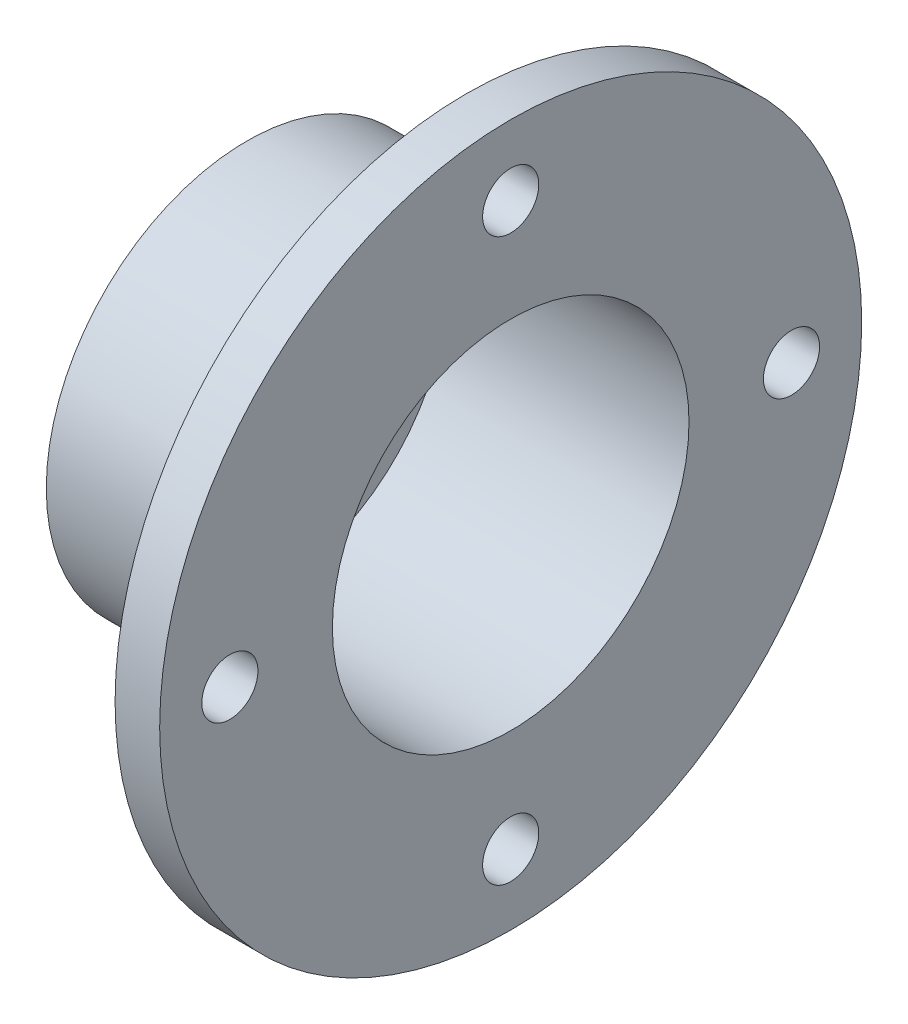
ISO-10303-21;
HEADER;
FILE_DESCRIPTION(('STEP AP214'),'2;1');
FILE_NAME('part.step','',(''),(''),'','','');
FILE_SCHEMA(('AUTOMOTIVE_DESIGN { 1 0 10303 214 1 1 1 1 }'));
ENDSEC;
DATA;
#1=APPLICATION_CONTEXT('core data for automotive mechanical design processes');
#2=APPLICATION_PROTOCOL_DEFINITION('international standard','automotive_design',2000,#1);
#3=PRODUCT_CONTEXT('',#1,'mechanical');
#4=PRODUCT('Part','Part','',(#3));
#5=PRODUCT_RELATED_PRODUCT_CATEGORY('part','',(#4));
#6=PRODUCT_DEFINITION_FORMATION('','',#4);
#7=PRODUCT_DEFINITION_CONTEXT('part definition',#1,'design');
#8=PRODUCT_DEFINITION('design','',#6,#7);
#9=PRODUCT_DEFINITION_SHAPE('','',#8);
#10=(LENGTH_UNIT() NAMED_UNIT(*) SI_UNIT(.MILLI.,.METRE.));
#11=(NAMED_UNIT(*) PLANE_ANGLE_UNIT() SI_UNIT($,.RADIAN.));
#12=(NAMED_UNIT(*) SI_UNIT($,.STERADIAN.) SOLID_ANGLE_UNIT());
#13=UNCERTAINTY_MEASURE_WITH_UNIT(LENGTH_MEASURE(1.E-05),#10,'distance_accuracy_value','');
#14=(GEOMETRIC_REPRESENTATION_CONTEXT(3) GLOBAL_UNCERTAINTY_ASSIGNED_CONTEXT((#13)) GLOBAL_UNIT_ASSIGNED_CONTEXT((#10,
#11,#12)) REPRESENTATION_CONTEXT('',''));
#15=CARTESIAN_POINT('',(0.,0.,0.));
#16=DIRECTION('',(0.,0.,1.));
#17=DIRECTION('',(1.,0.,0.));
#18=AXIS2_PLACEMENT_3D('',#15,#16,#17);
#19=CARTESIAN_POINT('',(0.,0.,0.));
#20=DIRECTION('',(-1.,0.,0.));
#21=DIRECTION('',(0.,0.,1.));
#22=AXIS2_PLACEMENT_3D('',#19,#20,#21);
#23=CYLINDRICAL_SURFACE('',#22,9.525);
#24=CARTESIAN_POINT('',(1.5875,0.,0.));
#25=DIRECTION('',(-1.,0.,0.));
#26=DIRECTION('',(0.,0.,1.));
#27=AXIS2_PLACEMENT_3D('',#24,#25,#26);
#28=CIRCLE('',#27,9.525);
#29=CARTESIAN_POINT('',(1.5875,0.,9.525));
#30=VERTEX_POINT('',#29);
#31=EDGE_CURVE('E60',#30,#30,#28,.T.);
#32=ORIENTED_EDGE('',*,*,#31,.F.);
#33=EDGE_LOOP('',(#32));
#34=FACE_BOUND('',#33,.T.);
#35=CARTESIAN_POINT('',(0.,0.,0.));
#36=DIRECTION('',(-1.,0.,0.));
#37=DIRECTION('',(0.,0.,1.));
#38=AXIS2_PLACEMENT_3D('',#35,#36,#37);
#39=CIRCLE('',#38,9.525);
#40=CARTESIAN_POINT('',(0.,0.,9.525));
#41=VERTEX_POINT('',#40);
#42=EDGE_CURVE('E10',#41,#41,#39,.T.);
#43=ORIENTED_EDGE('',*,*,#42,.T.);
#44=EDGE_LOOP('',(#43));
#45=FACE_BOUND('',#44,.T.);
#46=ADVANCED_FACE('F32',(#34,#45),#23,.F.);
#47=CARTESIAN_POINT('',(0.,9.525,0.));
#48=DIRECTION('',(1.,0.,0.));
#49=DIRECTION('',(0.,0.,-1.));
#50=AXIS2_PLACEMENT_3D('',#47,#48,#49);
#51=PLANE('',#50);
#52=ORIENTED_EDGE('',*,*,#42,.F.);
#53=EDGE_LOOP('',(#52));
#54=FACE_BOUND('',#53,.T.);
#55=CARTESIAN_POINT('',(0.,0.,0.));
#56=DIRECTION('',(-1.,0.,0.));
#57=DIRECTION('',(0.,0.,1.));
#58=AXIS2_PLACEMENT_3D('',#55,#56,#57);
#59=CIRCLE('',#58,14.2875);
#60=CARTESIAN_POINT('',(0.,0.,14.2875));
#61=VERTEX_POINT('',#60);
#62=EDGE_CURVE('E38',#61,#61,#59,.T.);
#63=ORIENTED_EDGE('',*,*,#62,.T.);
#64=EDGE_LOOP('',(#63));
#65=FACE_BOUND('',#64,.T.);
#66=ADVANCED_FACE('F133',(#54,#65),#51,.F.);
#67=CARTESIAN_POINT('',(0.,0.,0.));
#68=DIRECTION('',(-1.,0.,0.));
#69=DIRECTION('',(0.,0.,1.));
#70=AXIS2_PLACEMENT_3D('',#67,#68,#69);
#71=CYLINDRICAL_SURFACE('',#70,14.2875);
#72=ORIENTED_EDGE('',*,*,#62,.F.);
#73=EDGE_LOOP('',(#72));
#74=FACE_BOUND('',#73,.T.);
#75=CARTESIAN_POINT('',(15.6125,0.,0.));
#76=DIRECTION('',(-1.,0.,0.));
#77=DIRECTION('',(0.,0.,1.));
#78=AXIS2_PLACEMENT_3D('',#75,#76,#77);
#79=CIRCLE('',#78,14.2875);
#80=CARTESIAN_POINT('',(15.6125,0.,14.2875));
#81=VERTEX_POINT('',#80);
#82=EDGE_CURVE('E42',#81,#81,#79,.T.);
#83=ORIENTED_EDGE('',*,*,#82,.T.);
#84=EDGE_LOOP('',(#83));
#85=FACE_BOUND('',#84,.T.);
#86=ADVANCED_FACE('F95',(#74,#85),#71,.T.);
#87=CARTESIAN_POINT('',(15.6125,14.2875,0.));
#88=DIRECTION('',(1.,0.,0.));
#89=DIRECTION('',(0.,0.,-1.));
#90=AXIS2_PLACEMENT_3D('',#87,#88,#89);
#91=PLANE('',#90);
#92=CARTESIAN_POINT('',(15.6125,0.,20.));
#93=DIRECTION('',(-1.,0.,0.));
#94=DIRECTION('',(0.,0.,1.));
#95=AXIS2_PLACEMENT_3D('',#92,#93,#94);
#96=CIRCLE('',#95,2.);
#97=CARTESIAN_POINT('',(15.6125,0.,22.));
#98=VERTEX_POINT('',#97);
#99=EDGE_CURVE('E84',#98,#98,#96,.T.);
#100=ORIENTED_EDGE('',*,*,#99,.F.);
#101=EDGE_LOOP('',(#100));
#102=FACE_BOUND('',#101,.T.);
#103=CARTESIAN_POINT('',(15.6125,-20.,0.));
#104=DIRECTION('',(-1.,0.,0.));
#105=DIRECTION('',(0.,0.,1.));
#106=AXIS2_PLACEMENT_3D('',#103,#104,#105);
#107=CIRCLE('',#106,2.);
#108=CARTESIAN_POINT('',(15.6125,-20.,2.));
#109=VERTEX_POINT('',#108);
#110=EDGE_CURVE('E78',#109,#109,#107,.T.);
#111=ORIENTED_EDGE('',*,*,#110,.F.);
#112=EDGE_LOOP('',(#111));
#113=FACE_BOUND('',#112,.T.);
#114=CARTESIAN_POINT('',(15.6125,0.,-20.));
#115=DIRECTION('',(-1.,0.,0.));
#116=DIRECTION('',(0.,0.,1.));
#117=AXIS2_PLACEMENT_3D('',#114,#115,#116);
#118=CIRCLE('',#117,2.);
#119=CARTESIAN_POINT('',(15.6125,0.,-18.));
#120=VERTEX_POINT('',#119);
#121=EDGE_CURVE('E72',#120,#120,#118,.T.);
#122=ORIENTED_EDGE('',*,*,#121,.F.);
#123=EDGE_LOOP('',(#122));
#124=FACE_BOUND('',#123,.T.);
#125=CARTESIAN_POINT('',(15.6125,20.,0.));
#126=DIRECTION('',(-1.,0.,0.));
#127=DIRECTION('',(0.,0.,1.));
#128=AXIS2_PLACEMENT_3D('',#125,#126,#127);
#129=CIRCLE('',#128,2.);
#130=CARTESIAN_POINT('',(15.6125,20.,2.));
#131=VERTEX_POINT('',#130);
#132=EDGE_CURVE('E66',#131,#131,#129,.T.);
#133=ORIENTED_EDGE('',*,*,#132,.F.);
#134=EDGE_LOOP('',(#133));
#135=FACE_BOUND('',#134,.T.);
#136=ORIENTED_EDGE('',*,*,#82,.F.);
#137=EDGE_LOOP('',(#136));
#138=FACE_BOUND('',#137,.T.);
#139=CARTESIAN_POINT('',(15.6125,0.,0.));
#140=DIRECTION('',(-1.,0.,0.));
#141=DIRECTION('',(0.,0.,1.));
#142=AXIS2_PLACEMENT_3D('',#139,#140,#141);
#143=CIRCLE('',#142,25.);
#144=CARTESIAN_POINT('',(15.6125,0.,25.));
#145=VERTEX_POINT('',#144);
#146=EDGE_CURVE('E46',#145,#145,#143,.T.);
#147=ORIENTED_EDGE('',*,*,#146,.T.);
#148=EDGE_LOOP('',(#147));
#149=FACE_BOUND('',#148,.T.);
#150=ADVANCED_FACE('F91',(#102,#113,#124,#135,#138,#149),#91,.F.);
#151=CARTESIAN_POINT('',(0.,0.,0.));
#152=DIRECTION('',(-1.,0.,0.));
#153=DIRECTION('',(0.,0.,1.));
#154=AXIS2_PLACEMENT_3D('',#151,#152,#153);
#155=CYLINDRICAL_SURFACE('',#154,25.);
#156=ORIENTED_EDGE('',*,*,#146,.F.);
#157=EDGE_LOOP('',(#156));
#158=FACE_BOUND('',#157,.T.);
#159=CARTESIAN_POINT('',(18.7875,0.,0.));
#160=DIRECTION('',(-1.,0.,0.));
#161=DIRECTION('',(0.,0.,1.));
#162=AXIS2_PLACEMENT_3D('',#159,#160,#161);
#163=CIRCLE('',#162,25.);
#164=CARTESIAN_POINT('',(18.7875,0.,25.));
#165=VERTEX_POINT('',#164);
#166=EDGE_CURVE('E51',#165,#165,#163,.T.);
#167=ORIENTED_EDGE('',*,*,#166,.T.);
#168=EDGE_LOOP('',(#167));
#169=FACE_BOUND('',#168,.T.);
#170=ADVANCED_FACE('F94',(#158,#169),#155,.T.);
#171=CARTESIAN_POINT('',(18.7875,25.,0.));
#172=DIRECTION('',(-1.,0.,0.));
#173=DIRECTION('',(0.,0.,1.));
#174=AXIS2_PLACEMENT_3D('',#171,#172,#173);
#175=PLANE('',#174);
#176=CARTESIAN_POINT('',(18.7875,0.,20.));
#177=DIRECTION('',(-1.,0.,0.));
#178=DIRECTION('',(0.,0.,1.));
#179=AXIS2_PLACEMENT_3D('',#176,#177,#178);
#180=CIRCLE('',#179,2.);
#181=CARTESIAN_POINT('',(18.7875,0.,22.));
#182=VERTEX_POINT('',#181);
#183=EDGE_CURVE('E81',#182,#182,#180,.F.);
#184=ORIENTED_EDGE('',*,*,#183,.F.);
#185=EDGE_LOOP('',(#184));
#186=FACE_BOUND('',#185,.T.);
#187=CARTESIAN_POINT('',(18.7875,-20.,0.));
#188=DIRECTION('',(-1.,0.,0.));
#189=DIRECTION('',(0.,0.,1.));
#190=AXIS2_PLACEMENT_3D('',#187,#188,#189);
#191=CIRCLE('',#190,2.);
#192=CARTESIAN_POINT('',(18.7875,-20.,2.));
#193=VERTEX_POINT('',#192);
#194=EDGE_CURVE('E75',#193,#193,#191,.F.);
#195=ORIENTED_EDGE('',*,*,#194,.F.);
#196=EDGE_LOOP('',(#195));
#197=FACE_BOUND('',#196,.T.);
#198=CARTESIAN_POINT('',(18.7875,0.,-20.));
#199=DIRECTION('',(-1.,0.,0.));
#200=DIRECTION('',(0.,0.,1.));
#201=AXIS2_PLACEMENT_3D('',#198,#199,#200);
#202=CIRCLE('',#201,2.);
#203=CARTESIAN_POINT('',(18.7875,0.,-18.));
#204=VERTEX_POINT('',#203);
#205=EDGE_CURVE('E69',#204,#204,#202,.F.);
#206=ORIENTED_EDGE('',*,*,#205,.F.);
#207=EDGE_LOOP('',(#206));
#208=FACE_BOUND('',#207,.T.);
#209=CARTESIAN_POINT('',(18.7875,20.,0.));
#210=DIRECTION('',(-1.,0.,0.));
#211=DIRECTION('',(0.,0.,1.));
#212=AXIS2_PLACEMENT_3D('',#209,#210,#211);
#213=CIRCLE('',#212,2.);
#214=CARTESIAN_POINT('',(18.7875,20.,2.));
#215=VERTEX_POINT('',#214);
#216=EDGE_CURVE('E63',#215,#215,#213,.F.);
#217=ORIENTED_EDGE('',*,*,#216,.F.);
#218=EDGE_LOOP('',(#217));
#219=FACE_BOUND('',#218,.T.);
#220=ORIENTED_EDGE('',*,*,#166,.F.);
#221=EDGE_LOOP('',(#220));
#222=FACE_BOUND('',#221,.T.);
#223=CARTESIAN_POINT('',(18.7875,0.,0.));
#224=DIRECTION('',(-1.,0.,0.));
#225=DIRECTION('',(0.,0.,1.));
#226=AXIS2_PLACEMENT_3D('',#223,#224,#225);
#227=CIRCLE('',#226,12.7);
#228=CARTESIAN_POINT('',(18.7875,0.,12.7));
#229=VERTEX_POINT('',#228);
#230=EDGE_CURVE('E54',#229,#229,#227,.T.);
#231=ORIENTED_EDGE('',*,*,#230,.T.);
#232=EDGE_LOOP('',(#231));
#233=FACE_BOUND('',#232,.T.);
#234=ADVANCED_FACE('F109',(#186,#197,#208,#219,#222,#233),#175,.F.);
#235=CARTESIAN_POINT('',(0.,0.,0.));
#236=DIRECTION('',(-1.,0.,0.));
#237=DIRECTION('',(0.,0.,1.));
#238=AXIS2_PLACEMENT_3D('',#235,#236,#237);
#239=CYLINDRICAL_SURFACE('',#238,12.7);
#240=ORIENTED_EDGE('',*,*,#230,.F.);
#241=EDGE_LOOP('',(#240));
#242=FACE_BOUND('',#241,.T.);
#243=CARTESIAN_POINT('',(1.5875,0.,0.));
#244=DIRECTION('',(-1.,0.,0.));
#245=DIRECTION('',(0.,0.,1.));
#246=AXIS2_PLACEMENT_3D('',#243,#244,#245);
#247=CIRCLE('',#246,12.7);
#248=CARTESIAN_POINT('',(1.5875,0.,12.7));
#249=VERTEX_POINT('',#248);
#250=EDGE_CURVE('E57',#249,#249,#247,.T.);
#251=ORIENTED_EDGE('',*,*,#250,.T.);
#252=EDGE_LOOP('',(#251));
#253=FACE_BOUND('',#252,.T.);
#254=ADVANCED_FACE('F115',(#242,#253),#239,.F.);
#255=CARTESIAN_POINT('',(1.5875,12.7,0.));
#256=DIRECTION('',(-1.,0.,0.));
#257=DIRECTION('',(0.,0.,1.));
#258=AXIS2_PLACEMENT_3D('',#255,#256,#257);
#259=PLANE('',#258);
#260=ORIENTED_EDGE('',*,*,#250,.F.);
#261=EDGE_LOOP('',(#260));
#262=FACE_BOUND('',#261,.T.);
#263=ORIENTED_EDGE('',*,*,#31,.T.);
#264=EDGE_LOOP('',(#263));
#265=FACE_BOUND('',#264,.T.);
#266=ADVANCED_FACE('F122',(#262,#265),#259,.F.);
#267=CARTESIAN_POINT('',(18.7885,20.,0.));
#268=DIRECTION('',(-1.,0.,0.));
#269=DIRECTION('',(0.,0.,1.));
#270=AXIS2_PLACEMENT_3D('',#267,#268,#269);
#271=CYLINDRICAL_SURFACE('',#270,2.);
#272=ORIENTED_EDGE('',*,*,#132,.T.);
#273=EDGE_LOOP('',(#272));
#274=FACE_BOUND('',#273,.T.);
#275=ORIENTED_EDGE('',*,*,#216,.T.);
#276=EDGE_LOOP('',(#275));
#277=FACE_BOUND('',#276,.T.);
#278=ADVANCED_FACE('F128',(#274,#277),#271,.F.);
#279=CARTESIAN_POINT('',(18.7885,0.,-20.));
#280=DIRECTION('',(-1.,0.,0.));
#281=DIRECTION('',(0.,0.,1.));
#282=AXIS2_PLACEMENT_3D('',#279,#280,#281);
#283=CYLINDRICAL_SURFACE('',#282,2.);
#284=ORIENTED_EDGE('',*,*,#121,.T.);
#285=EDGE_LOOP('',(#284));
#286=FACE_BOUND('',#285,.T.);
#287=ORIENTED_EDGE('',*,*,#205,.T.);
#288=EDGE_LOOP('',(#287));
#289=FACE_BOUND('',#288,.T.);
#290=ADVANCED_FACE('F146',(#286,#289),#283,.F.);
#291=CARTESIAN_POINT('',(18.7885,-20.,0.));
#292=DIRECTION('',(-1.,0.,0.));
#293=DIRECTION('',(0.,0.,1.));
#294=AXIS2_PLACEMENT_3D('',#291,#292,#293);
#295=CYLINDRICAL_SURFACE('',#294,2.);
#296=ORIENTED_EDGE('',*,*,#110,.T.);
#297=EDGE_LOOP('',(#296));
#298=FACE_BOUND('',#297,.T.);
#299=ORIENTED_EDGE('',*,*,#194,.T.);
#300=EDGE_LOOP('',(#299));
#301=FACE_BOUND('',#300,.T.);
#302=ADVANCED_FACE('F150',(#298,#301),#295,.F.);
#303=CARTESIAN_POINT('',(18.7885,0.,20.));
#304=DIRECTION('',(-1.,0.,0.));
#305=DIRECTION('',(0.,0.,1.));
#306=AXIS2_PLACEMENT_3D('',#303,#304,#305);
#307=CYLINDRICAL_SURFACE('',#306,2.);
#308=ORIENTED_EDGE('',*,*,#99,.T.);
#309=EDGE_LOOP('',(#308));
#310=FACE_BOUND('',#309,.T.);
#311=ORIENTED_EDGE('',*,*,#183,.T.);
#312=EDGE_LOOP('',(#311));
#313=FACE_BOUND('',#312,.T.);
#314=ADVANCED_FACE('F88',(#310,#313),#307,.F.);
#315=CLOSED_SHELL('',(#46,#66,#86,#150,#170,#234,#254,#266,#278,#290,#302,#314));
#316=MANIFOLD_SOLID_BREP('B2',#315);
#317=ADVANCED_BREP_SHAPE_REPRESENTATION('',(#18,#316),#14);
#318=SHAPE_DEFINITION_REPRESENTATION(#9,#317);
ENDSEC;
END-ISO-10303-21;
